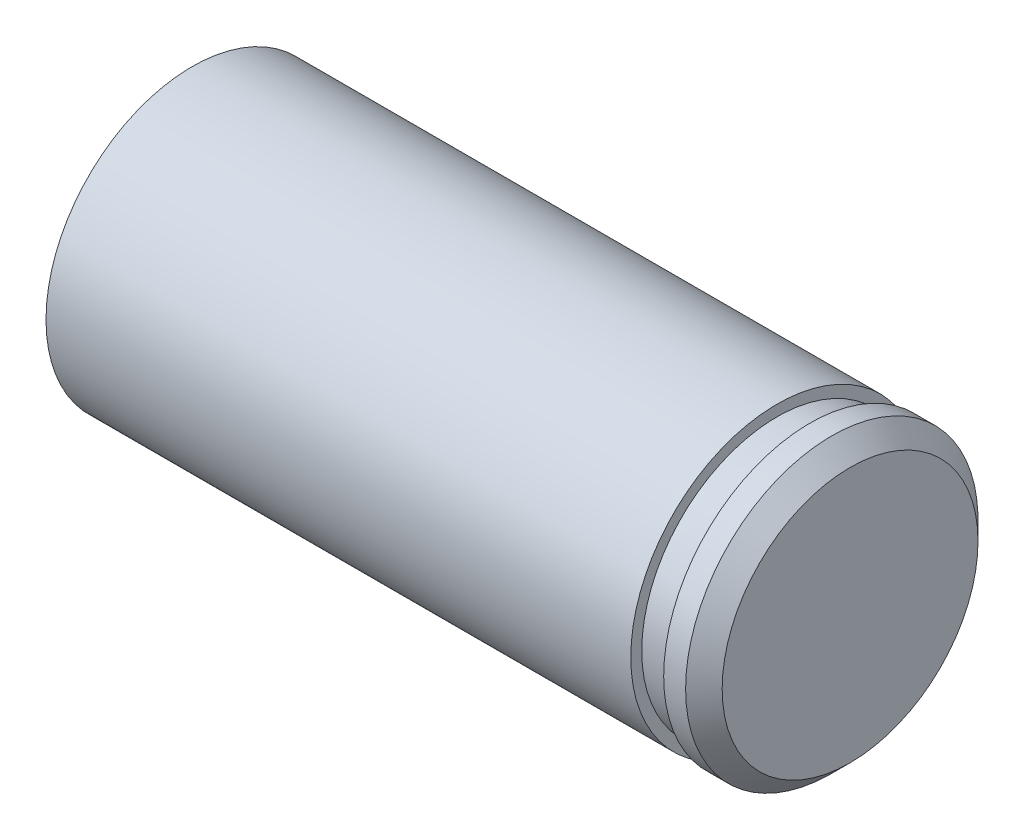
ISO-10303-21;
HEADER;
FILE_DESCRIPTION(('STEP AP214'),'2;1');
FILE_NAME('part.step','',(''),(''),'','','');
FILE_SCHEMA(('AUTOMOTIVE_DESIGN { 1 0 10303 214 1 1 1 1 }'));
ENDSEC;
DATA;
#1=APPLICATION_CONTEXT('core data for automotive mechanical design processes');
#2=APPLICATION_PROTOCOL_DEFINITION('international standard','automotive_design',2000,#1);
#3=PRODUCT_CONTEXT('',#1,'mechanical');
#4=PRODUCT('Part','Part','',(#3));
#5=PRODUCT_RELATED_PRODUCT_CATEGORY('part','',(#4));
#6=PRODUCT_DEFINITION_FORMATION('','',#4);
#7=PRODUCT_DEFINITION_CONTEXT('part definition',#1,'design');
#8=PRODUCT_DEFINITION('design','',#6,#7);
#9=PRODUCT_DEFINITION_SHAPE('','',#8);
#10=(LENGTH_UNIT() NAMED_UNIT(*) SI_UNIT(.MILLI.,.METRE.));
#11=(NAMED_UNIT(*) PLANE_ANGLE_UNIT() SI_UNIT($,.RADIAN.));
#12=(NAMED_UNIT(*) SI_UNIT($,.STERADIAN.) SOLID_ANGLE_UNIT());
#13=UNCERTAINTY_MEASURE_WITH_UNIT(LENGTH_MEASURE(1.E-05),#10,'distance_accuracy_value','');
#14=(GEOMETRIC_REPRESENTATION_CONTEXT(3) GLOBAL_UNCERTAINTY_ASSIGNED_CONTEXT((#13)) GLOBAL_UNIT_ASSIGNED_CONTEXT((#10,
#11,#12)) REPRESENTATION_CONTEXT('',''));
#15=CARTESIAN_POINT('',(0.,0.,0.));
#16=DIRECTION('',(0.,0.,1.));
#17=DIRECTION('',(1.,0.,0.));
#18=AXIS2_PLACEMENT_3D('',#15,#16,#17);
#19=CARTESIAN_POINT('',(0.,0.,0.));
#20=DIRECTION('',(1.,0.,0.));
#21=DIRECTION('',(0.,0.,-1.));
#22=AXIS2_PLACEMENT_3D('',#19,#20,#21);
#23=PLANE('',#22);
#24=CARTESIAN_POINT('',(0.,0.,0.));
#25=DIRECTION('',(-1.,0.,0.));
#26=DIRECTION('',(0.,0.,1.));
#27=AXIS2_PLACEMENT_3D('',#24,#25,#26);
#28=CIRCLE('',#27,2.1);
#29=CARTESIAN_POINT('',(0.,0.,2.1));
#30=VERTEX_POINT('',#29);
#31=EDGE_CURVE('E49',#30,#30,#28,.T.);
#32=ORIENTED_EDGE('',*,*,#31,.F.);
#33=EDGE_LOOP('',(#32));
#34=FACE_BOUND('',#33,.T.);
#35=CARTESIAN_POINT('',(0.,0.,0.));
#36=DIRECTION('',(-1.,0.,0.));
#37=DIRECTION('',(0.,0.,1.));
#38=AXIS2_PLACEMENT_3D('',#35,#36,#37);
#39=CIRCLE('',#38,3.99999999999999);
#40=CARTESIAN_POINT('',(0.,0.,3.99999999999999));
#41=VERTEX_POINT('',#40);
#42=EDGE_CURVE('E11',#41,#41,#39,.T.);
#43=ORIENTED_EDGE('',*,*,#42,.T.);
#44=EDGE_LOOP('',(#43));
#45=FACE_BOUND('',#44,.T.);
#46=ADVANCED_FACE('F31',(#34,#45),#23,.F.);
#47=CARTESIAN_POINT('',(-21.2463096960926,0.,0.));
#48=DIRECTION('',(-1.,0.,0.));
#49=DIRECTION('',(0.,0.,1.));
#50=AXIS2_PLACEMENT_3D('',#47,#48,#49);
#51=CYLINDRICAL_SURFACE('',#50,3.99999999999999);
#52=ORIENTED_EDGE('',*,*,#42,.F.);
#53=EDGE_LOOP('',(#52));
#54=FACE_BOUND('',#53,.T.);
#55=CARTESIAN_POINT('',(16.,0.,0.));
#56=DIRECTION('',(-1.,0.,0.));
#57=DIRECTION('',(0.,0.,1.));
#58=AXIS2_PLACEMENT_3D('',#55,#56,#57);
#59=CIRCLE('',#58,3.99999999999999);
#60=CARTESIAN_POINT('',(16.,0.,3.99999999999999));
#61=VERTEX_POINT('',#60);
#62=EDGE_CURVE('E37',#61,#61,#59,.T.);
#63=ORIENTED_EDGE('',*,*,#62,.T.);
#64=EDGE_LOOP('',(#63));
#65=FACE_BOUND('',#64,.T.);
#66=ADVANCED_FACE('F71',(#54,#65),#51,.T.);
#67=CARTESIAN_POINT('',(16.,3.99999999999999,0.));
#68=DIRECTION('',(-1.,0.,0.));
#69=DIRECTION('',(0.,0.,1.));
#70=AXIS2_PLACEMENT_3D('',#67,#68,#69);
#71=PLANE('',#70);
#72=ORIENTED_EDGE('',*,*,#62,.F.);
#73=EDGE_LOOP('',(#72));
#74=FACE_BOUND('',#73,.T.);
#75=CARTESIAN_POINT('',(16.,0.,0.));
#76=DIRECTION('',(-1.,0.,0.));
#77=DIRECTION('',(0.,0.,1.));
#78=AXIS2_PLACEMENT_3D('',#75,#76,#77);
#79=CIRCLE('',#78,3.69999999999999);
#80=CARTESIAN_POINT('',(16.,0.,3.69999999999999));
#81=VERTEX_POINT('',#80);
#82=EDGE_CURVE('E66',#81,#81,#79,.T.);
#83=ORIENTED_EDGE('',*,*,#82,.T.);
#84=EDGE_LOOP('',(#83));
#85=FACE_BOUND('',#84,.T.);
#86=ADVANCED_FACE('F73',(#74,#85),#71,.F.);
#87=CARTESIAN_POINT('',(-21.2463096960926,0.,0.));
#88=DIRECTION('',(-1.,0.,0.));
#89=DIRECTION('',(0.,0.,1.));
#90=AXIS2_PLACEMENT_3D('',#87,#88,#89);
#91=CYLINDRICAL_SURFACE('',#90,3.69999999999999);
#92=ORIENTED_EDGE('',*,*,#82,.F.);
#93=EDGE_LOOP('',(#92));
#94=FACE_BOUND('',#93,.T.);
#95=CARTESIAN_POINT('',(16.9,0.,0.));
#96=DIRECTION('',(-1.,0.,0.));
#97=DIRECTION('',(0.,0.,1.));
#98=AXIS2_PLACEMENT_3D('',#95,#96,#97);
#99=CIRCLE('',#98,3.69999999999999);
#100=CARTESIAN_POINT('',(16.9,0.,3.69999999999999));
#101=VERTEX_POINT('',#100);
#102=EDGE_CURVE('E63',#101,#101,#99,.T.);
#103=ORIENTED_EDGE('',*,*,#102,.T.);
#104=EDGE_LOOP('',(#103));
#105=FACE_BOUND('',#104,.T.);
#106=ADVANCED_FACE('F76',(#94,#105),#91,.T.);
#107=CARTESIAN_POINT('',(16.9,3.69999999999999,0.));
#108=DIRECTION('',(1.,0.,0.));
#109=DIRECTION('',(0.,0.,-1.));
#110=AXIS2_PLACEMENT_3D('',#107,#108,#109);
#111=PLANE('',#110);
#112=ORIENTED_EDGE('',*,*,#102,.F.);
#113=EDGE_LOOP('',(#112));
#114=FACE_BOUND('',#113,.T.);
#115=CARTESIAN_POINT('',(16.9,0.,0.));
#116=DIRECTION('',(-1.,0.,0.));
#117=DIRECTION('',(0.,0.,1.));
#118=AXIS2_PLACEMENT_3D('',#115,#116,#117);
#119=CIRCLE('',#118,3.99999999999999);
#120=CARTESIAN_POINT('',(16.9,0.,3.99999999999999));
#121=VERTEX_POINT('',#120);
#122=EDGE_CURVE('E60',#121,#121,#119,.T.);
#123=ORIENTED_EDGE('',*,*,#122,.T.);
#124=EDGE_LOOP('',(#123));
#125=FACE_BOUND('',#124,.T.);
#126=ADVANCED_FACE('F82',(#114,#125),#111,.F.);
#127=CARTESIAN_POINT('',(-21.2463096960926,0.,0.));
#128=DIRECTION('',(-1.,0.,0.));
#129=DIRECTION('',(0.,0.,1.));
#130=AXIS2_PLACEMENT_3D('',#127,#128,#129);
#131=CYLINDRICAL_SURFACE('',#130,4.);
#132=ORIENTED_EDGE('',*,*,#122,.F.);
#133=EDGE_LOOP('',(#132));
#134=FACE_BOUND('',#133,.T.);
#135=CARTESIAN_POINT('',(17.5,0.,0.));
#136=DIRECTION('',(-1.,0.,0.));
#137=DIRECTION('',(0.,0.,1.));
#138=AXIS2_PLACEMENT_3D('',#135,#136,#137);
#139=CIRCLE('',#138,4.);
#140=CARTESIAN_POINT('',(17.5,0.,4.));
#141=VERTEX_POINT('',#140);
#142=EDGE_CURVE('E57',#141,#141,#139,.T.);
#143=ORIENTED_EDGE('',*,*,#142,.T.);
#144=EDGE_LOOP('',(#143));
#145=FACE_BOUND('',#144,.T.);
#146=ADVANCED_FACE('F88',(#134,#145),#131,.T.);
#147=CARTESIAN_POINT('',(18.,0.,0.));
#148=DIRECTION('',(-1.,0.,0.));
#149=DIRECTION('',(0.,0.,1.));
#150=AXIS2_PLACEMENT_3D('',#147,#148,#149);
#151=CONICAL_SURFACE('',#150,3.49999999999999,0.78539816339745);
#152=ORIENTED_EDGE('',*,*,#142,.F.);
#153=EDGE_LOOP('',(#152));
#154=FACE_BOUND('',#153,.T.);
#155=CARTESIAN_POINT('',(18.,0.,0.));
#156=DIRECTION('',(-1.,0.,0.));
#157=DIRECTION('',(0.,0.,1.));
#158=AXIS2_PLACEMENT_3D('',#155,#156,#157);
#159=CIRCLE('',#158,3.49999999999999);
#160=CARTESIAN_POINT('',(18.,0.,3.49999999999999));
#161=VERTEX_POINT('',#160);
#162=EDGE_CURVE('E52',#161,#161,#159,.T.);
#163=ORIENTED_EDGE('',*,*,#162,.T.);
#164=EDGE_LOOP('',(#163));
#165=FACE_BOUND('',#164,.T.);
#166=ADVANCED_FACE('F94',(#154,#165),#151,.T.);
#167=CARTESIAN_POINT('',(18.,3.49999999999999,0.));
#168=DIRECTION('',(-1.,0.,0.));
#169=DIRECTION('',(0.,0.,1.));
#170=AXIS2_PLACEMENT_3D('',#167,#168,#169);
#171=PLANE('',#170);
#172=ORIENTED_EDGE('',*,*,#162,.F.);
#173=EDGE_LOOP('',(#172));
#174=FACE_BOUND('',#173,.T.);
#175=ADVANCED_FACE('F100',(#174),#171,.F.);
#176=CARTESIAN_POINT('',(0.,0.,0.));
#177=DIRECTION('',(-1.,0.,0.));
#178=DIRECTION('',(0.,0.,1.));
#179=AXIS2_PLACEMENT_3D('',#176,#177,#178);
#180=CYLINDRICAL_SURFACE('',#179,2.1);
#181=CARTESIAN_POINT('',(12.,0.,0.));
#182=DIRECTION('',(-1.,0.,0.));
#183=DIRECTION('',(0.,0.,1.));
#184=AXIS2_PLACEMENT_3D('',#181,#182,#183);
#185=CIRCLE('',#184,2.1);
#186=CARTESIAN_POINT('',(12.,0.,2.1));
#187=VERTEX_POINT('',#186);
#188=EDGE_CURVE('E47',#187,#187,#185,.T.);
#189=ORIENTED_EDGE('',*,*,#188,.F.);
#190=EDGE_LOOP('',(#189));
#191=FACE_BOUND('',#190,.T.);
#192=ORIENTED_EDGE('',*,*,#31,.T.);
#193=EDGE_LOOP('',(#192));
#194=FACE_BOUND('',#193,.T.);
#195=ADVANCED_FACE('F43',(#191,#194),#180,.F.);
#196=CARTESIAN_POINT('',(12.,0.,0.));
#197=DIRECTION('',(-1.,0.,0.));
#198=DIRECTION('',(0.,0.,1.));
#199=AXIS2_PLACEMENT_3D('',#196,#197,#198);
#200=CONICAL_SURFACE('',#199,2.1,1.0471975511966);
#201=CARTESIAN_POINT('',(13.2124355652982,0.,0.));
#202=VERTEX_POINT('',#201);
#203=VERTEX_LOOP('',#202);
#204=FACE_BOUND('',#203,.T.);
#205=ORIENTED_EDGE('',*,*,#188,.T.);
#206=EDGE_LOOP('',(#205));
#207=FACE_BOUND('',#206,.T.);
#208=ADVANCED_FACE('F40',(#204,#207),#200,.F.);
#209=CLOSED_SHELL('',(#46,#66,#86,#106,#126,#146,#166,#175,#195,#208));
#210=MANIFOLD_SOLID_BREP('B2',#209);
#211=ADVANCED_BREP_SHAPE_REPRESENTATION('',(#18,#210),#14);
#212=SHAPE_DEFINITION_REPRESENTATION(#9,#211);
ENDSEC;
END-ISO-10303-21;
